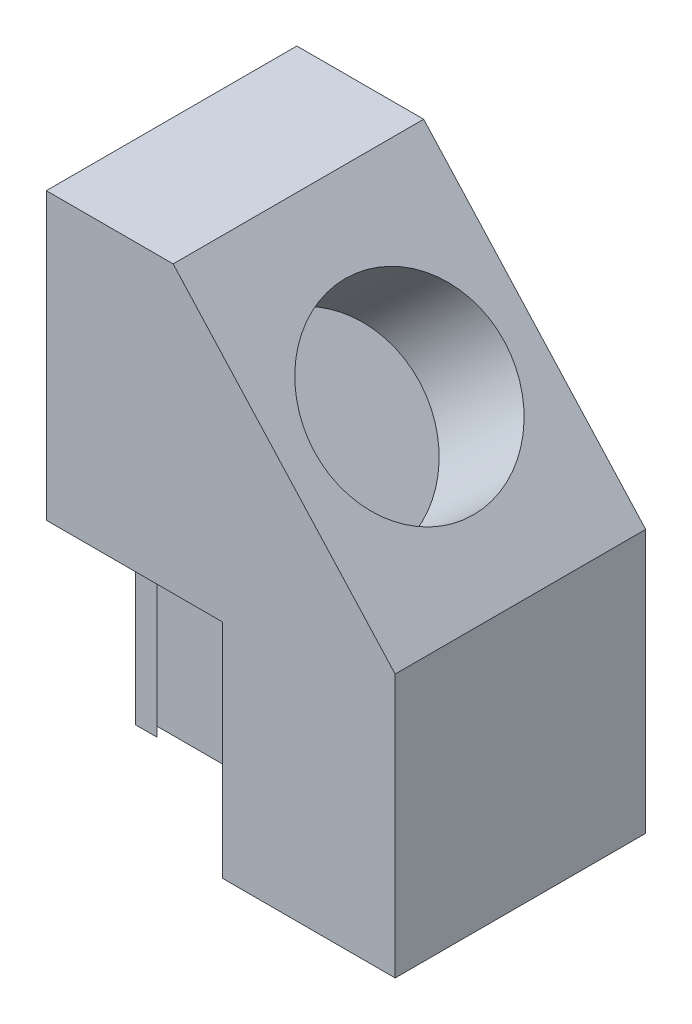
from build123d import *

# Parameters (mm, degrees)
EXTRUDE1_DEPTH     = 50.165
SKETCH2_R          = 38.1
CUT_EXTRUDE1_DEPTH = 45.974
SKETCH3_W          = 70.568074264
SKETCH3_H          = 88.9
CUT_EXTRUDE2_DEPTH = 35.814
CUT_EXTRUDE3_DEPTH = 88.9


with BuildPart() as part:
    # Sketch1 → Extrude1 (new, symmetric)
    with BuildSketch(Plane.XY):
        Polygon((50.8, 203.2), (139.7, 105.41), (139.7, 0), (0, 0), (0, 203.2), align=None)
    extrude(amount=EXTRUDE1_DEPTH, both=True)

    # Sketch2 → Cut-Extrude1 (cut)
    with BuildSketch(Plane(origin=(128.953846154, 117.230769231, 0), x_dir=(0, 0, -1), z_dir=(0.7399400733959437, 0.6726727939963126, 0))):
        with Locations(Location((0, 50.104369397, 0), (0, 0, 90))):
            Circle(SKETCH2_R)
    extrude(amount=-CUT_EXTRUDE1_DEPTH, mode=Mode.SUBTRACT)

    # Sketch3 → Cut-Extrude2 (cut)
    with BuildSketch(Plane.XY.offset(50.165)):
        with Locations((35.284037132, 44.45)):
            Rectangle(SKETCH3_W, SKETCH3_H)
    extrude(amount=-CUT_EXTRUDE2_DEPTH, mode=Mode.SUBTRACT)

    # Sketch4 → Cut-Extrude3 (cut)
    with BuildSketch(Plane.XZ):
        Polygon((61.954037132, 14.351), (65.764037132, 10.541), (4.804037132, 10.541), (8.614037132, 14.351), align=None)
    extrude(amount=-CUT_EXTRUDE3_DEPTH, mode=Mode.SUBTRACT)


solid = part.part
